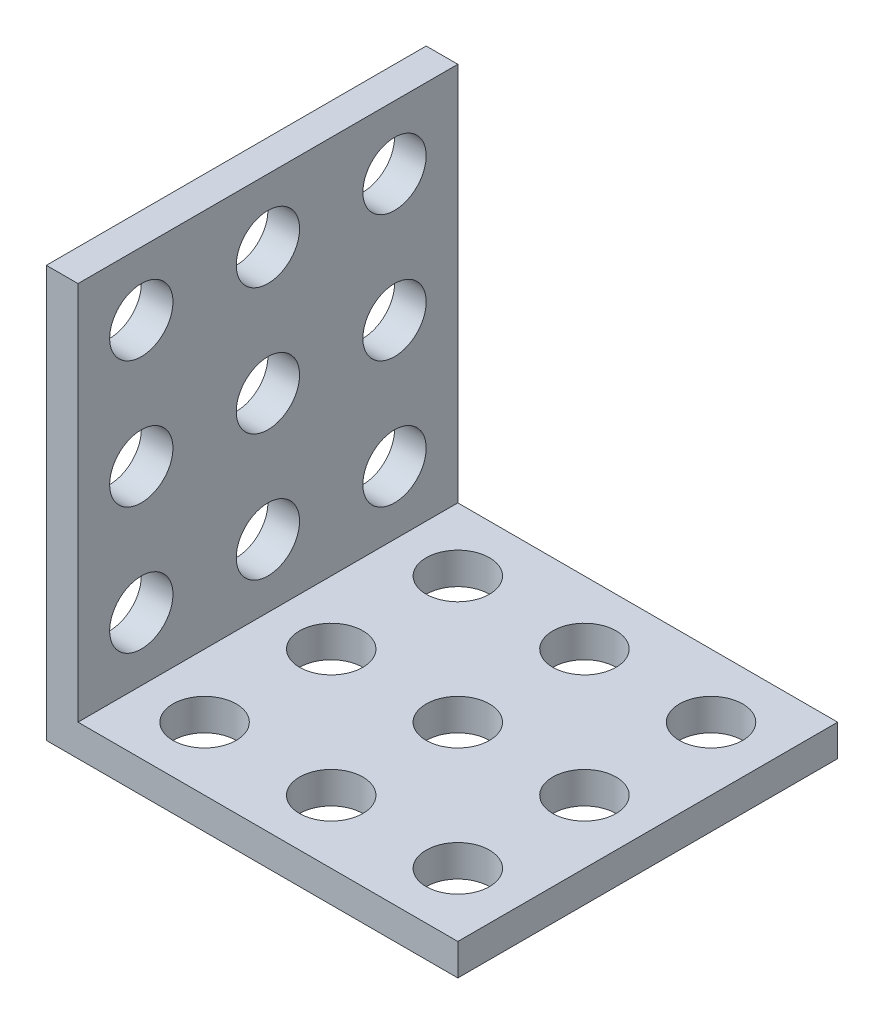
from build123d import *

# Parameters (mm, degrees)
EXTRUDE_1_DEPTH     = 24
SKETCH_2_R          = 2
CUT_EXTRUDE_1_DEPTH = 24
SKETCH_3_R          = 2
CUT_EXTRUDE_2_DEPTH = 24


with BuildPart() as part:
    # Sketch 1 → Extrude 1 (new body)
    with BuildSketch(Plane.XY):
        Polygon((0, 0), (0, 26), (2, 26), (2, 2), (26, 2), (26, 0), align=None)
    extrude(amount=EXTRUDE_1_DEPTH)

    # Sketch 2 → Cut-Extrude 1 (cut)
    with BuildSketch(Plane(origin=(0, 2, 0), x_dir=(1, 0, 0), z_dir=(0, 1, 0))):
        with Locations(Location((6, -20, 0), (0, 0, 180))):
            Circle(SKETCH_2_R)
        with Locations(Location((14, -20, 0), (0, 0, 180))):
            Circle(SKETCH_2_R)
        with Locations(Location((22, -20, 0), (0, 0, 180))):
            Circle(SKETCH_2_R)
        with Locations(Location((14, -12, 0), (0, 0, 180))):
            Circle(SKETCH_2_R)
        with Locations(Location((22, -12, 0), (0, 0, 180))):
            Circle(SKETCH_2_R)
        with Locations(Location((14, -4, 0), (0, 0, 180))):
            Circle(SKETCH_2_R)
        with Locations(Location((22, -4, 0), (0, 0, 180))):
            Circle(SKETCH_2_R)
        with Locations(Location((6, -12, 0), (0, 0, 180))):
            Circle(SKETCH_2_R)
        with Locations(Location((6, -4, 0), (0, 0, 180))):
            Circle(SKETCH_2_R)
    extrude(amount=-CUT_EXTRUDE_1_DEPTH, mode=Mode.SUBTRACT)

    # Sketch 3 → Cut-Extrude 2 (cut)
    with BuildSketch(Plane(origin=(2, 0, 0), x_dir=(0, 0, -1), z_dir=(1, 0, 0))):
        with Locations(Location((-20, 6, 0), (0, 0, 90))):
            Circle(SKETCH_3_R)
        with Locations(Location((-12, 6, 0), (0, 0, 90))):
            Circle(SKETCH_3_R)
        with Locations(Location((-4, 6, 0), (0, 0, 90))):
            Circle(SKETCH_3_R)
        with Locations(Location((-12, 14, 0), (0, 0, 90))):
            Circle(SKETCH_3_R)
        with Locations(Location((-4, 14, 0), (0, 0, 90))):
            Circle(SKETCH_3_R)
        with Locations(Location((-12, 22, 0), (0, 0, 90))):
            Circle(SKETCH_3_R)
        with Locations(Location((-4, 22, 0), (0, 0, 90))):
            Circle(SKETCH_3_R)
        with Locations(Location((-20, 14, 0), (0, 0, 90))):
            Circle(SKETCH_3_R)
        with Locations(Location((-20, 22, 0), (0, 0, 90))):
            Circle(SKETCH_3_R)
    extrude(amount=-CUT_EXTRUDE_2_DEPTH, mode=Mode.SUBTRACT)


solid = part.part
